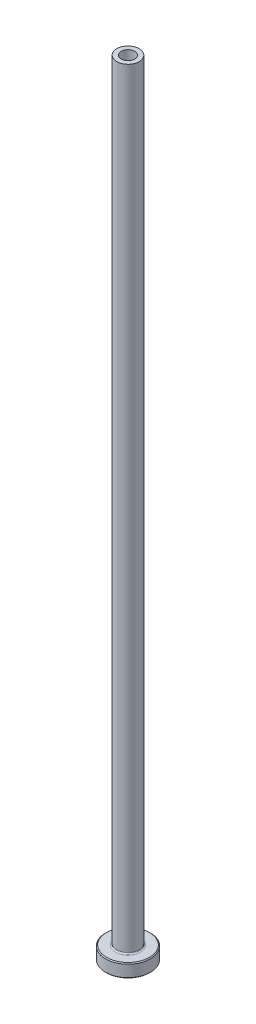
from build123d import *

# Parameters (mm, degrees)
FILLET1_R     = 0.3
CHAMFER1_SIZE = 0.2
CHAMFER3_SIZE = 0.5


with BuildPart() as part:
    # Sketch1 → Revolve1 (revolve)
    with BuildSketch(Plane.XY, mode=Mode.PRIVATE) as revolve1_sk:
        Polygon((-1.5, 175), (-2.5, 175), (-2.5, 3), (-5, 3), (-5, 0), (-1.75, 0), (-1.75, 118), (-1.5, 130), align=None)
    revolve(revolve1_sk.sketch.rotate(Axis((0, 92.187680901, 0), (0, -1, 0)), 270), axis=Axis((0, 92.187680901, 0), (0, -1, 0)))

    # Fillet1
    fillet1_edges = [part.edges().sort_by_distance(p)[0] for p in [
        (0, 3, -2.5),
    ]]
    fillet(fillet1_edges, radius=FILLET1_R)

    # Chamfer1
    chamfer1_edges = [part.edges().sort_by_distance(p)[0] for p in [
        (0, 0, -5),
        (0, 3, -5),
    ]]
    chamfer(chamfer1_edges, length=CHAMFER1_SIZE)

    # Chamfer3
    chamfer3_edges = [part.edges().sort_by_distance(p)[0] for p in [
        (0, 0, -1.75),
    ]]
    chamfer(chamfer3_edges, length=CHAMFER3_SIZE)


solid = part.part
